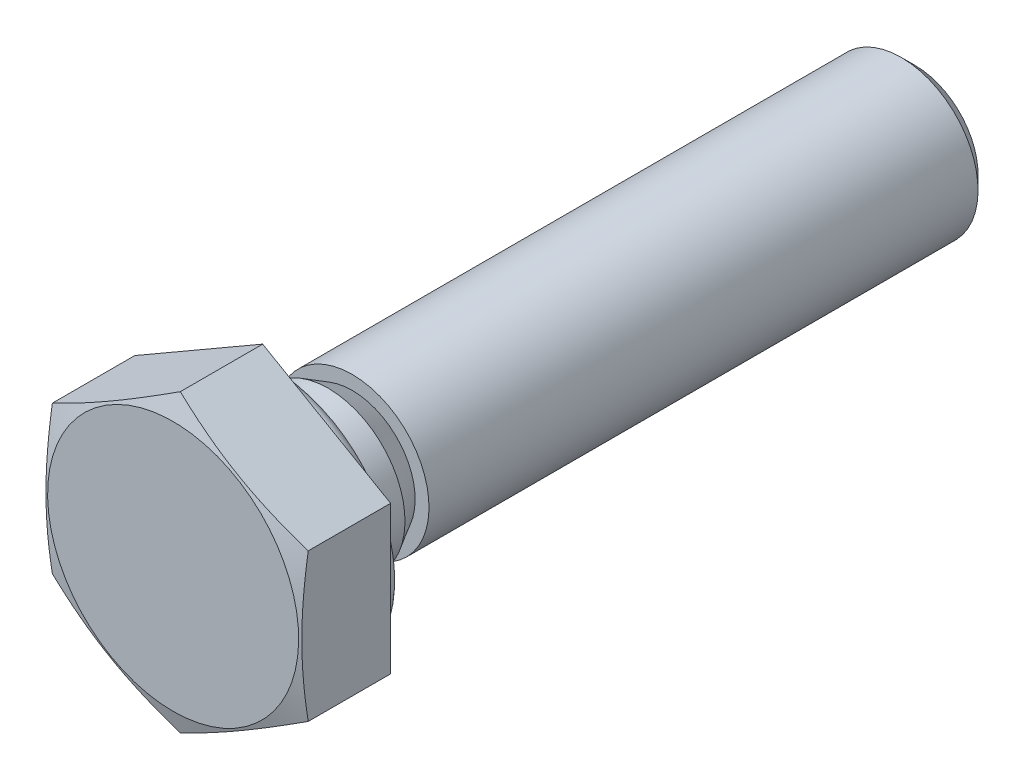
ISO-10303-21;
HEADER;
FILE_DESCRIPTION(('STEP AP214'),'2;1');
FILE_NAME('part.step','',(''),(''),'','','');
FILE_SCHEMA(('AUTOMOTIVE_DESIGN { 1 0 10303 214 1 1 1 1 }'));
ENDSEC;
DATA;
#1=APPLICATION_CONTEXT('core data for automotive mechanical design processes');
#2=APPLICATION_PROTOCOL_DEFINITION('international standard','automotive_design',2000,#1);
#3=PRODUCT_CONTEXT('',#1,'mechanical');
#4=PRODUCT('Part','Part','',(#3));
#5=PRODUCT_RELATED_PRODUCT_CATEGORY('part','',(#4));
#6=PRODUCT_DEFINITION_FORMATION('','',#4);
#7=PRODUCT_DEFINITION_CONTEXT('part definition',#1,'design');
#8=PRODUCT_DEFINITION('design','',#6,#7);
#9=PRODUCT_DEFINITION_SHAPE('','',#8);
#10=(LENGTH_UNIT() NAMED_UNIT(*) SI_UNIT(.MILLI.,.METRE.));
#11=(NAMED_UNIT(*) PLANE_ANGLE_UNIT() SI_UNIT($,.RADIAN.));
#12=(NAMED_UNIT(*) SI_UNIT($,.STERADIAN.) SOLID_ANGLE_UNIT());
#13=UNCERTAINTY_MEASURE_WITH_UNIT(LENGTH_MEASURE(1.E-05),#10,'distance_accuracy_value','');
#14=(GEOMETRIC_REPRESENTATION_CONTEXT(3) GLOBAL_UNCERTAINTY_ASSIGNED_CONTEXT((#13)) GLOBAL_UNIT_ASSIGNED_CONTEXT((#10,
#11,#12)) REPRESENTATION_CONTEXT('',''));
#15=CARTESIAN_POINT('',(0.,0.,0.));
#16=DIRECTION('',(0.,0.,1.));
#17=DIRECTION('',(1.,0.,0.));
#18=AXIS2_PLACEMENT_3D('',#15,#16,#17);
#19=CARTESIAN_POINT('',(0.,1.229375,-25.));
#20=DIRECTION('',(0.,0.,-1.));
#21=DIRECTION('',(0.,1.,0.));
#22=AXIS2_PLACEMENT_3D('',#19,#20,#21);
#23=PLANE('',#22);
#24=CARTESIAN_POINT('',(0.,0.,-25.));
#25=DIRECTION('',(0.,0.,-1.));
#26=DIRECTION('',(0.,1.,0.));
#27=AXIS2_PLACEMENT_3D('',#24,#25,#26);
#28=CIRCLE('',#27,2.45875);
#29=CARTESIAN_POINT('',(0.,2.45875,-25.));
#30=VERTEX_POINT('',#29);
#31=EDGE_CURVE('E11',#30,#30,#28,.T.);
#32=ORIENTED_EDGE('',*,*,#31,.T.);
#33=EDGE_LOOP('',(#32));
#34=FACE_BOUND('',#33,.T.);
#35=ADVANCED_FACE('F17',(#34),#23,.T.);
#36=CARTESIAN_POINT('',(0.,0.,-24.729375));
#37=DIRECTION('',(0.,0.,1.));
#38=DIRECTION('',(0.,1.,0.));
#39=AXIS2_PLACEMENT_3D('',#36,#37,#38);
#40=CONICAL_SURFACE('',#39,2.729375,0.78539816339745);
#41=CARTESIAN_POINT('',(0.,0.,-24.45875));
#42=DIRECTION('',(0.,0.,-1.));
#43=DIRECTION('',(0.,1.,0.));
#44=AXIS2_PLACEMENT_3D('',#41,#42,#43);
#45=CIRCLE('',#44,3.);
#46=CARTESIAN_POINT('',(0.,3.,-24.45875));
#47=VERTEX_POINT('',#46);
#48=EDGE_CURVE('E25',#47,#47,#45,.T.);
#49=ORIENTED_EDGE('',*,*,#48,.T.);
#50=EDGE_LOOP('',(#49));
#51=FACE_BOUND('',#50,.T.);
#52=ORIENTED_EDGE('',*,*,#31,.F.);
#53=EDGE_LOOP('',(#52));
#54=FACE_BOUND('',#53,.T.);
#55=ADVANCED_FACE('F247',(#51,#54),#40,.T.);
#56=CARTESIAN_POINT('',(0.,0.,-13.729375));
#57=DIRECTION('',(0.,0.,1.));
#58=DIRECTION('',(0.,1.,0.));
#59=AXIS2_PLACEMENT_3D('',#56,#57,#58);
#60=CYLINDRICAL_SURFACE('',#59,3.);
#61=CARTESIAN_POINT('',(0.,0.,-3.));
#62=DIRECTION('',(0.,0.,-1.));
#63=DIRECTION('',(0.,1.,0.));
#64=AXIS2_PLACEMENT_3D('',#61,#62,#63);
#65=CIRCLE('',#64,3.);
#66=CARTESIAN_POINT('',(0.,3.,-3.));
#67=VERTEX_POINT('',#66);
#68=EDGE_CURVE('E224',#67,#67,#65,.T.);
#69=ORIENTED_EDGE('',*,*,#68,.T.);
#70=EDGE_LOOP('',(#69));
#71=FACE_BOUND('',#70,.T.);
#72=ORIENTED_EDGE('',*,*,#48,.F.);
#73=EDGE_LOOP('',(#72));
#74=FACE_BOUND('',#73,.T.);
#75=ADVANCED_FACE('F231',(#71,#74),#60,.T.);
#76=CARTESIAN_POINT('',(0.,2.729375,-3.));
#77=DIRECTION('',(0.,0.,1.));
#78=DIRECTION('',(0.,-1.,0.));
#79=AXIS2_PLACEMENT_3D('',#76,#77,#78);
#80=PLANE('',#79);
#81=CARTESIAN_POINT('',(0.,0.,-3.));
#82=DIRECTION('',(0.,0.,-1.));
#83=DIRECTION('',(0.,1.,0.));
#84=AXIS2_PLACEMENT_3D('',#81,#82,#83);
#85=CIRCLE('',#84,2.45875);
#86=CARTESIAN_POINT('',(0.,2.45875,-3.));
#87=VERTEX_POINT('',#86);
#88=EDGE_CURVE('E221',#87,#87,#85,.T.);
#89=ORIENTED_EDGE('',*,*,#88,.T.);
#90=EDGE_LOOP('',(#89));
#91=FACE_BOUND('',#90,.T.);
#92=ORIENTED_EDGE('',*,*,#68,.F.);
#93=EDGE_LOOP('',(#92));
#94=FACE_BOUND('',#93,.T.);
#95=ADVANCED_FACE('F234',(#91,#94),#80,.T.);
#96=CARTESIAN_POINT('',(0.,0.,-2.53126375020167));
#97=DIRECTION('',(0.,0.,1.));
#98=DIRECTION('',(0.,1.,0.));
#99=AXIS2_PLACEMENT_3D('',#96,#97,#98);
#100=CONICAL_SURFACE('',#99,2.729375,0.523598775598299);
#101=CARTESIAN_POINT('',(0.,0.,-2.06252750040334));
#102=DIRECTION('',(0.,0.,-1.));
#103=DIRECTION('',(0.,1.,0.));
#104=AXIS2_PLACEMENT_3D('',#101,#102,#103);
#105=CIRCLE('',#104,3.);
#106=CARTESIAN_POINT('',(0.,3.,-2.06252750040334));
#107=VERTEX_POINT('',#106);
#108=EDGE_CURVE('E218',#107,#107,#105,.T.);
#109=ORIENTED_EDGE('',*,*,#108,.T.);
#110=EDGE_LOOP('',(#109));
#111=FACE_BOUND('',#110,.T.);
#112=ORIENTED_EDGE('',*,*,#88,.F.);
#113=EDGE_LOOP('',(#112));
#114=FACE_BOUND('',#113,.T.);
#115=ADVANCED_FACE('F236',(#111,#114),#100,.T.);
#116=CARTESIAN_POINT('',(0.,0.,-1.18126375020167));
#117=DIRECTION('',(0.,0.,1.));
#118=DIRECTION('',(0.,1.,0.));
#119=AXIS2_PLACEMENT_3D('',#116,#117,#118);
#120=CYLINDRICAL_SURFACE('',#119,3.);
#121=CARTESIAN_POINT('',(0.,0.,-0.3));
#122=DIRECTION('',(0.,0.,-1.));
#123=DIRECTION('',(0.,1.,0.));
#124=AXIS2_PLACEMENT_3D('',#121,#122,#123);
#125=CIRCLE('',#124,3.);
#126=CARTESIAN_POINT('',(0.,3.,-0.3));
#127=VERTEX_POINT('',#126);
#128=EDGE_CURVE('E215',#127,#127,#125,.T.);
#129=ORIENTED_EDGE('',*,*,#128,.T.);
#130=EDGE_LOOP('',(#129));
#131=FACE_BOUND('',#130,.T.);
#132=ORIENTED_EDGE('',*,*,#108,.F.);
#133=EDGE_LOOP('',(#132));
#134=FACE_BOUND('',#133,.T.);
#135=ADVANCED_FACE('F244',(#131,#134),#120,.T.);
#136=CARTESIAN_POINT('',(0.,0.,-0.3));
#137=DIRECTION('',(0.,0.,-1.));
#138=DIRECTION('',(-1.,0.,0.));
#139=AXIS2_PLACEMENT_3D('',#136,#137,#138);
#140=TOROIDAL_SURFACE('',#139,3.3,0.3);
#141=CARTESIAN_POINT('',(0.,0.,0.));
#142=DIRECTION('',(0.,0.,-1.));
#143=DIRECTION('',(0.,1.,0.));
#144=AXIS2_PLACEMENT_3D('',#141,#142,#143);
#145=CIRCLE('',#144,3.3);
#146=CARTESIAN_POINT('',(0.,3.3,0.));
#147=VERTEX_POINT('',#146);
#148=EDGE_CURVE('E212',#147,#147,#145,.T.);
#149=ORIENTED_EDGE('',*,*,#148,.T.);
#150=EDGE_LOOP('',(#149));
#151=FACE_BOUND('',#150,.T.);
#152=ORIENTED_EDGE('',*,*,#128,.F.);
#153=EDGE_LOOP('',(#152));
#154=FACE_BOUND('',#153,.T.);
#155=ADVANCED_FACE('F290',(#151,#154),#140,.F.);
#156=CARTESIAN_POINT('',(0.,3.875,0.));
#157=DIRECTION('',(0.,0.,-1.));
#158=DIRECTION('',(0.,1.,0.));
#159=AXIS2_PLACEMENT_3D('',#156,#157,#158);
#160=PLANE('',#159);
#161=CARTESIAN_POINT('',(0.,0.,0.));
#162=DIRECTION('',(0.,0.,-1.));
#163=DIRECTION('',(0.,1.,0.));
#164=AXIS2_PLACEMENT_3D('',#161,#162,#163);
#165=CIRCLE('',#164,4.45);
#166=CARTESIAN_POINT('',(0.,4.45,0.));
#167=VERTEX_POINT('',#166);
#168=EDGE_CURVE('E209',#167,#167,#165,.T.);
#169=ORIENTED_EDGE('',*,*,#168,.T.);
#170=EDGE_LOOP('',(#169));
#171=FACE_BOUND('',#170,.T.);
#172=ORIENTED_EDGE('',*,*,#148,.F.);
#173=EDGE_LOOP('',(#172));
#174=FACE_BOUND('',#173,.T.);
#175=ADVANCED_FACE('F299',(#171,#174),#160,.T.);
#176=CARTESIAN_POINT('',(0.,0.,0.5));
#177=DIRECTION('',(0.,0.,-1.));
#178=DIRECTION('',(-1.,0.,0.));
#179=AXIS2_PLACEMENT_3D('',#176,#177,#178);
#180=TOROIDAL_SURFACE('',#179,4.45,0.5);
#181=CARTESIAN_POINT('',(0.,0.,0.5));
#182=DIRECTION('',(0.,0.,-1.));
#183=DIRECTION('',(0.,1.,0.));
#184=AXIS2_PLACEMENT_3D('',#181,#182,#183);
#185=CIRCLE('',#184,4.95);
#186=CARTESIAN_POINT('',(0.,4.95,0.5));
#187=VERTEX_POINT('',#186);
#188=EDGE_CURVE('E139',#187,#187,#185,.T.);
#189=ORIENTED_EDGE('',*,*,#188,.T.);
#190=EDGE_LOOP('',(#189));
#191=FACE_BOUND('',#190,.T.);
#192=ORIENTED_EDGE('',*,*,#168,.F.);
#193=EDGE_LOOP('',(#192));
#194=FACE_BOUND('',#193,.T.);
#195=ADVANCED_FACE('F309',(#191,#194),#180,.T.);
#196=CARTESIAN_POINT('',(0.,0.,4.));
#197=DIRECTION('',(0.,0.,-1.));
#198=DIRECTION('',(-1.,0.,0.));
#199=AXIS2_PLACEMENT_3D('',#196,#197,#198);
#200=PLANE('',#199);
#201=CARTESIAN_POINT('',(0.,0.,4.));
#202=DIRECTION('',(0.,0.,1.));
#203=DIRECTION('',(0.,1.,0.));
#204=AXIS2_PLACEMENT_3D('',#201,#202,#203);
#205=CIRCLE('',#204,4.90621247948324);
#206=CARTESIAN_POINT('',(0.,-4.90621247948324,4.));
#207=VERTEX_POINT('',#206);
#208=EDGE_CURVE('E162',#207,#207,#205,.T.);
#209=ORIENTED_EDGE('',*,*,#208,.T.);
#210=EDGE_LOOP('',(#209));
#211=FACE_BOUND('',#210,.T.);
#212=ADVANCED_FACE('F319',(#211),#200,.F.);
#213=CARTESIAN_POINT('',(-2.5,4.33125,4.));
#214=DIRECTION('',(-0.500097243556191,0.865969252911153,0.));
#215=DIRECTION('',(0.865969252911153,0.500097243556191,0.));
#216=AXIS2_PLACEMENT_3D('',#213,#214,#215);
#217=PLANE('',#216);
#218=CARTESIAN_POINT('',(-5.19638650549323,2.77408679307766,3.68145454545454));
#219=CARTESIAN_POINT('',(-2.500972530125,4.33068836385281,4.21373838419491));
#220=CARTESIAN_POINT('',(0.194441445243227,5.88728993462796,3.68145454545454));
#221=(BOUNDED_CURVE() B_SPLINE_CURVE(2,(#218,#219,#220),.UNSPECIFIED.,.F.,
.F.) B_SPLINE_CURVE_WITH_KNOTS((3,3),(0.,6.25176417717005),
.UNSPECIFIED.) CURVE() GEOMETRIC_REPRESENTATION_ITEM() RATIONAL_B_SPLINE_CURVE((1.,
1.17787091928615,1.)) REPRESENTATION_ITEM(''));
#222=CARTESIAN_POINT('',(-5.,2.8875,3.71919728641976));
#223=VERTEX_POINT('',#222);
#224=CARTESIAN_POINT('',(0.,5.775,3.71883386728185));
#225=VERTEX_POINT('',#224);
#226=EDGE_CURVE('E133',#223,#225,#221,.T.);
#227=ORIENTED_EDGE('',*,*,#226,.T.);
#228=DIRECTION('',(0.,0.,-1.));
#229=VECTOR('',#228,1.);
#230=CARTESIAN_POINT('',(0.,5.775,4.));
#231=LINE('',#230,#229);
#232=CARTESIAN_POINT('',(0.,5.775,0.5));
#233=VERTEX_POINT('',#232);
#234=EDGE_CURVE('E106',#225,#233,#231,.T.);
#235=ORIENTED_EDGE('',*,*,#234,.T.);
#236=DIRECTION('',(-0.865969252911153,-0.500097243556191,0.));
#237=VECTOR('',#236,1.);
#238=CARTESIAN_POINT('',(-5.,2.8875,0.5));
#239=LINE('',#238,#237);
#240=CARTESIAN_POINT('',(-5.,2.8875,0.5));
#241=VERTEX_POINT('',#240);
#242=EDGE_CURVE('E110',#233,#241,#239,.T.);
#243=ORIENTED_EDGE('',*,*,#242,.T.);
#244=DIRECTION('',(0.,0.,-1.));
#245=VECTOR('',#244,1.);
#246=CARTESIAN_POINT('',(-5.,2.8875,4.));
#247=LINE('',#246,#245);
#248=EDGE_CURVE('E95',#223,#241,#247,.T.);
#249=ORIENTED_EDGE('',*,*,#248,.F.);
#250=EDGE_LOOP('',(#227,#235,#243,#249));
#251=FACE_BOUND('',#250,.T.);
#252=ADVANCED_FACE('F111',(#251),#217,.T.);
#253=CARTESIAN_POINT('',(2.5,4.33125,4.));
#254=DIRECTION('',(0.500097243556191,0.865969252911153,0.));
#255=DIRECTION('',(0.865969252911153,-0.500097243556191,0.));
#256=AXIS2_PLACEMENT_3D('',#253,#254,#255);
#257=PLANE('',#256);
#258=CARTESIAN_POINT('',(-0.194441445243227,5.88728993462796,3.68145454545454));
#259=CARTESIAN_POINT('',(2.500972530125,4.33068836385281,4.21373838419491));
#260=CARTESIAN_POINT('',(5.19638650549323,2.77408679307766,3.68145454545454));
#261=(BOUNDED_CURVE() B_SPLINE_CURVE(2,(#258,#259,#260),.UNSPECIFIED.,.F.,
.F.) B_SPLINE_CURVE_WITH_KNOTS((3,3),(0.,6.25176417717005),
.UNSPECIFIED.) CURVE() GEOMETRIC_REPRESENTATION_ITEM() RATIONAL_B_SPLINE_CURVE((1.,
1.17787091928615,1.)) REPRESENTATION_ITEM(''));
#262=CARTESIAN_POINT('',(5.,2.8875,3.71919728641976));
#263=VERTEX_POINT('',#262);
#264=EDGE_CURVE('E127',#225,#263,#261,.T.);
#265=ORIENTED_EDGE('',*,*,#264,.T.);
#266=DIRECTION('',(0.,0.,-1.));
#267=VECTOR('',#266,1.);
#268=CARTESIAN_POINT('',(5.,2.8875,4.));
#269=LINE('',#268,#267);
#270=CARTESIAN_POINT('',(5.,2.8875,0.5));
#271=VERTEX_POINT('',#270);
#272=EDGE_CURVE('E177',#263,#271,#269,.T.);
#273=ORIENTED_EDGE('',*,*,#272,.T.);
#274=DIRECTION('',(-0.865969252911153,0.500097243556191,0.));
#275=VECTOR('',#274,1.);
#276=CARTESIAN_POINT('',(0.,5.775,0.5));
#277=LINE('',#276,#275);
#278=EDGE_CURVE('E116',#271,#233,#277,.T.);
#279=ORIENTED_EDGE('',*,*,#278,.T.);
#280=ORIENTED_EDGE('',*,*,#234,.F.);
#281=EDGE_LOOP('',(#265,#273,#279,#280));
#282=FACE_BOUND('',#281,.T.);
#283=ADVANCED_FACE('F338',(#282),#257,.T.);
#284=CARTESIAN_POINT('',(-5.,0.,4.));
#285=DIRECTION('',(-1.,0.,0.));
#286=DIRECTION('',(0.,1.,0.));
#287=AXIS2_PLACEMENT_3D('',#284,#285,#286);
#288=PLANE('',#287);
#289=CARTESIAN_POINT('',(-5.,-3.11415963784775,3.68145454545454));
#290=CARTESIAN_POINT('',(-5.,0.,4.21427270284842));
#291=CARTESIAN_POINT('',(-5.,3.11415963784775,3.68145454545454));
#292=(BOUNDED_CURVE() B_SPLINE_CURVE(2,(#289,#290,#291),.UNSPECIFIED.,.F.,
.F.) B_SPLINE_CURVE_WITH_KNOTS((3,3),(0.,6.25493259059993),
.UNSPECIFIED.) CURVE() GEOMETRIC_REPRESENTATION_ITEM() RATIONAL_B_SPLINE_CURVE((1.,1.1781,1.)) REPRESENTATION_ITEM(''));
#293=CARTESIAN_POINT('',(-5.,-2.8875,3.71919728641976));
#294=VERTEX_POINT('',#293);
#295=EDGE_CURVE('E101',#294,#223,#292,.T.);
#296=ORIENTED_EDGE('',*,*,#295,.T.);
#297=ORIENTED_EDGE('',*,*,#248,.T.);
#298=DIRECTION('',(0.,-1.,0.));
#299=VECTOR('',#298,1.);
#300=CARTESIAN_POINT('',(-5.,-2.8875,0.5));
#301=LINE('',#300,#299);
#302=CARTESIAN_POINT('',(-5.,-2.8875,0.5));
#303=VERTEX_POINT('',#302);
#304=EDGE_CURVE('E99',#241,#303,#301,.T.);
#305=ORIENTED_EDGE('',*,*,#304,.T.);
#306=DIRECTION('',(0.,0.,-1.));
#307=VECTOR('',#306,1.);
#308=CARTESIAN_POINT('',(-5.,-2.8875,4.));
#309=LINE('',#308,#307);
#310=EDGE_CURVE('E107',#294,#303,#309,.T.);
#311=ORIENTED_EDGE('',*,*,#310,.F.);
#312=EDGE_LOOP('',(#296,#297,#305,#311));
#313=FACE_BOUND('',#312,.T.);
#314=ADVANCED_FACE('F97',(#313),#288,.T.);
#315=CARTESIAN_POINT('',(-2.5,-4.33125,4.));
#316=DIRECTION('',(-0.500097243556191,-0.865969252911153,0.));
#317=DIRECTION('',(-0.865969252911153,0.500097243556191,0.));
#318=AXIS2_PLACEMENT_3D('',#315,#316,#317);
#319=PLANE('',#318);
#320=CARTESIAN_POINT('',(0.194441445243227,-5.88728993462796,3.68145454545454));
#321=CARTESIAN_POINT('',(-2.500972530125,-4.33068836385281,4.21373838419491));
#322=CARTESIAN_POINT('',(-5.19638650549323,-2.77408679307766,3.68145454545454));
#323=(BOUNDED_CURVE() B_SPLINE_CURVE(2,(#320,#321,#322),.UNSPECIFIED.,.F.,
.F.) B_SPLINE_CURVE_WITH_KNOTS((3,3),(0.,6.25176417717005),
.UNSPECIFIED.) CURVE() GEOMETRIC_REPRESENTATION_ITEM() RATIONAL_B_SPLINE_CURVE((1.,
1.17787091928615,1.)) REPRESENTATION_ITEM(''));
#324=CARTESIAN_POINT('',(0.,-5.775,3.71883386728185));
#325=VERTEX_POINT('',#324);
#326=EDGE_CURVE('E147',#325,#294,#323,.T.);
#327=ORIENTED_EDGE('',*,*,#326,.T.);
#328=ORIENTED_EDGE('',*,*,#310,.T.);
#329=DIRECTION('',(0.865969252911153,-0.500097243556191,0.));
#330=VECTOR('',#329,1.);
#331=CARTESIAN_POINT('',(0.,-5.775,0.5));
#332=LINE('',#331,#330);
#333=CARTESIAN_POINT('',(0.,-5.775,0.5));
#334=VERTEX_POINT('',#333);
#335=EDGE_CURVE('E122',#303,#334,#332,.T.);
#336=ORIENTED_EDGE('',*,*,#335,.T.);
#337=DIRECTION('',(0.,0.,-1.));
#338=VECTOR('',#337,1.);
#339=CARTESIAN_POINT('',(0.,-5.775,4.));
#340=LINE('',#339,#338);
#341=EDGE_CURVE('E180',#325,#334,#340,.T.);
#342=ORIENTED_EDGE('',*,*,#341,.F.);
#343=EDGE_LOOP('',(#327,#328,#336,#342));
#344=FACE_BOUND('',#343,.T.);
#345=ADVANCED_FACE('F356',(#344),#319,.T.);
#346=CARTESIAN_POINT('',(2.5,-4.33125,4.));
#347=DIRECTION('',(0.500097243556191,-0.865969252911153,0.));
#348=DIRECTION('',(-0.865969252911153,-0.500097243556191,0.));
#349=AXIS2_PLACEMENT_3D('',#346,#347,#348);
#350=PLANE('',#349);
#351=CARTESIAN_POINT('',(5.19638650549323,-2.77408679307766,3.68145454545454));
#352=CARTESIAN_POINT('',(2.500972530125,-4.33068836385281,4.21373838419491));
#353=CARTESIAN_POINT('',(-0.194441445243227,-5.88728993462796,3.68145454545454));
#354=(BOUNDED_CURVE() B_SPLINE_CURVE(2,(#351,#352,#353),.UNSPECIFIED.,.F.,
.F.) B_SPLINE_CURVE_WITH_KNOTS((3,3),(0.,6.25176417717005),
.UNSPECIFIED.) CURVE() GEOMETRIC_REPRESENTATION_ITEM() RATIONAL_B_SPLINE_CURVE((1.,
1.17787091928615,1.)) REPRESENTATION_ITEM(''));
#355=CARTESIAN_POINT('',(5.,-2.8875,3.71919728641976));
#356=VERTEX_POINT('',#355);
#357=EDGE_CURVE('E156',#356,#325,#354,.T.);
#358=ORIENTED_EDGE('',*,*,#357,.T.);
#359=ORIENTED_EDGE('',*,*,#341,.T.);
#360=DIRECTION('',(0.865969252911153,0.500097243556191,0.));
#361=VECTOR('',#360,1.);
#362=CARTESIAN_POINT('',(5.,-2.8875,0.5));
#363=LINE('',#362,#361);
#364=CARTESIAN_POINT('',(5.,-2.8875,0.5));
#365=VERTEX_POINT('',#364);
#366=EDGE_CURVE('E140',#334,#365,#363,.T.);
#367=ORIENTED_EDGE('',*,*,#366,.T.);
#368=DIRECTION('',(0.,0.,-1.));
#369=VECTOR('',#368,1.);
#370=CARTESIAN_POINT('',(5.,-2.8875,4.));
#371=LINE('',#370,#369);
#372=EDGE_CURVE('E146',#356,#365,#371,.T.);
#373=ORIENTED_EDGE('',*,*,#372,.F.);
#374=EDGE_LOOP('',(#358,#359,#367,#373));
#375=FACE_BOUND('',#374,.T.);
#376=ADVANCED_FACE('F365',(#375),#350,.T.);
#377=CARTESIAN_POINT('',(5.,0.,4.));
#378=DIRECTION('',(1.,0.,0.));
#379=DIRECTION('',(0.,-1.,0.));
#380=AXIS2_PLACEMENT_3D('',#377,#378,#379);
#381=PLANE('',#380);
#382=CARTESIAN_POINT('',(5.,3.11415963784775,3.68145454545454));
#383=CARTESIAN_POINT('',(5.,0.,4.21427270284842));
#384=CARTESIAN_POINT('',(5.,-3.11415963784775,3.68145454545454));
#385=(BOUNDED_CURVE() B_SPLINE_CURVE(2,(#382,#383,#384),.UNSPECIFIED.,.F.,
.F.) B_SPLINE_CURVE_WITH_KNOTS((3,3),(0.,6.25493259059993),
.UNSPECIFIED.) CURVE() GEOMETRIC_REPRESENTATION_ITEM() RATIONAL_B_SPLINE_CURVE((1.,1.1781,1.)) REPRESENTATION_ITEM(''));
#386=EDGE_CURVE('E134',#263,#356,#385,.T.);
#387=ORIENTED_EDGE('',*,*,#386,.T.);
#388=ORIENTED_EDGE('',*,*,#372,.T.);
#389=DIRECTION('',(0.,1.,0.));
#390=VECTOR('',#389,1.);
#391=CARTESIAN_POINT('',(5.,2.8875,0.5));
#392=LINE('',#391,#390);
#393=EDGE_CURVE('E165',#365,#271,#392,.T.);
#394=ORIENTED_EDGE('',*,*,#393,.T.);
#395=ORIENTED_EDGE('',*,*,#272,.F.);
#396=EDGE_LOOP('',(#387,#388,#394,#395));
#397=FACE_BOUND('',#396,.T.);
#398=ADVANCED_FACE('F375',(#397),#381,.T.);
#399=CARTESIAN_POINT('',(0.,0.,3.84372727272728));
#400=DIRECTION('',(0.,0.,-1.));
#401=DIRECTION('',(0.,1.,0.));
#402=AXIS2_PLACEMENT_3D('',#399,#400,#401);
#403=CONICAL_SURFACE('',#402,5.38908640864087,1.25780359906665);
#404=ORIENTED_EDGE('',*,*,#295,.F.);
#405=ORIENTED_EDGE('',*,*,#326,.F.);
#406=ORIENTED_EDGE('',*,*,#357,.F.);
#407=ORIENTED_EDGE('',*,*,#386,.F.);
#408=ORIENTED_EDGE('',*,*,#264,.F.);
#409=ORIENTED_EDGE('',*,*,#226,.F.);
#410=EDGE_LOOP('',(#404,#405,#406,#407,#408,#409));
#411=FACE_BOUND('',#410,.T.);
#412=ORIENTED_EDGE('',*,*,#208,.F.);
#413=EDGE_LOOP('',(#412));
#414=FACE_BOUND('',#413,.T.);
#415=ADVANCED_FACE('F385',(#411,#414),#403,.T.);
#416=CARTESIAN_POINT('',(0.,0.,0.5));
#417=DIRECTION('',(0.,0.,-1.));
#418=DIRECTION('',(-1.,0.,0.));
#419=AXIS2_PLACEMENT_3D('',#416,#417,#418);
#420=PLANE('',#419);
#421=ORIENTED_EDGE('',*,*,#188,.F.);
#422=EDGE_LOOP('',(#421));
#423=FACE_BOUND('',#422,.T.);
#424=ORIENTED_EDGE('',*,*,#304,.F.);
#425=ORIENTED_EDGE('',*,*,#242,.F.);
#426=ORIENTED_EDGE('',*,*,#278,.F.);
#427=ORIENTED_EDGE('',*,*,#393,.F.);
#428=ORIENTED_EDGE('',*,*,#366,.F.);
#429=ORIENTED_EDGE('',*,*,#335,.F.);
#430=EDGE_LOOP('',(#424,#425,#426,#427,#428,#429));
#431=FACE_BOUND('',#430,.T.);
#432=ADVANCED_FACE('F119',(#423,#431),#420,.T.);
#433=CLOSED_SHELL('',(#35,#55,#75,#95,#115,#135,#155,#175,#195,#212,#252,#283,#314,#345,#376,
#398,#415,#432));
#434=MANIFOLD_SOLID_BREP('B1',#433);
#435=ADVANCED_BREP_SHAPE_REPRESENTATION('',(#18,#434),#14);
#436=SHAPE_DEFINITION_REPRESENTATION(#9,#435);
ENDSEC;
END-ISO-10303-21;
